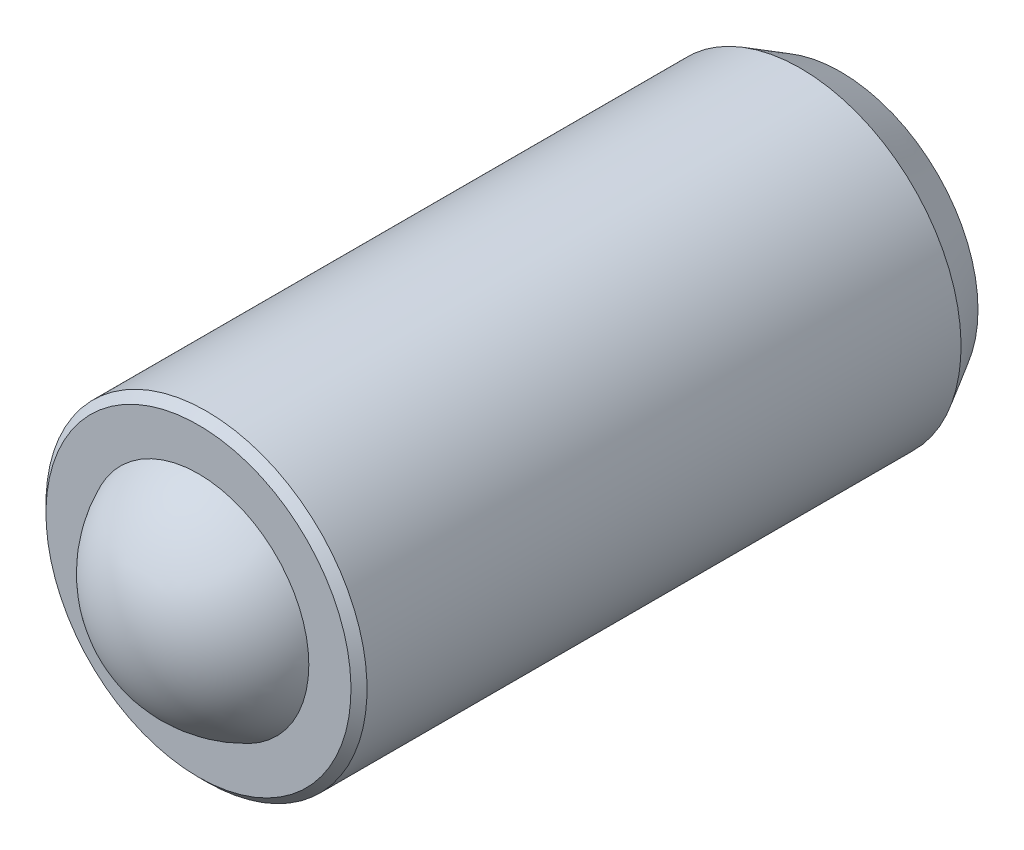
ISO-10303-21;
HEADER;
FILE_DESCRIPTION(('STEP AP214'),'2;1');
FILE_NAME('part.step','',(''),(''),'','','');
FILE_SCHEMA(('AUTOMOTIVE_DESIGN { 1 0 10303 214 1 1 1 1 }'));
ENDSEC;
DATA;
#1=APPLICATION_CONTEXT('core data for automotive mechanical design processes');
#2=APPLICATION_PROTOCOL_DEFINITION('international standard','automotive_design',2000,#1);
#3=PRODUCT_CONTEXT('',#1,'mechanical');
#4=PRODUCT('Part','Part','',(#3));
#5=PRODUCT_RELATED_PRODUCT_CATEGORY('part','',(#4));
#6=PRODUCT_DEFINITION_FORMATION('','',#4);
#7=PRODUCT_DEFINITION_CONTEXT('part definition',#1,'design');
#8=PRODUCT_DEFINITION('design','',#6,#7);
#9=PRODUCT_DEFINITION_SHAPE('','',#8);
#10=(LENGTH_UNIT() NAMED_UNIT(*) SI_UNIT(.MILLI.,.METRE.));
#11=(NAMED_UNIT(*) PLANE_ANGLE_UNIT() SI_UNIT($,.RADIAN.));
#12=(NAMED_UNIT(*) SI_UNIT($,.STERADIAN.) SOLID_ANGLE_UNIT());
#13=UNCERTAINTY_MEASURE_WITH_UNIT(LENGTH_MEASURE(1.E-05),#10,'distance_accuracy_value','');
#14=(GEOMETRIC_REPRESENTATION_CONTEXT(3) GLOBAL_UNCERTAINTY_ASSIGNED_CONTEXT((#13)) GLOBAL_UNIT_ASSIGNED_CONTEXT((#10,
#11,#12)) REPRESENTATION_CONTEXT('',''));
#15=CARTESIAN_POINT('',(0.,0.,0.));
#16=DIRECTION('',(0.,0.,1.));
#17=DIRECTION('',(1.,0.,0.));
#18=AXIS2_PLACEMENT_3D('',#15,#16,#17);
#19=CARTESIAN_POINT('',(0.,0.,0.));
#20=DIRECTION('',(0.,0.,-1.));
#21=DIRECTION('',(0.,1.,0.));
#22=AXIS2_PLACEMENT_3D('',#19,#20,#21);
#23=PLANE('',#22);
#24=CARTESIAN_POINT('',(0.,0.,0.));
#25=DIRECTION('',(0.,0.,-1.));
#26=DIRECTION('',(0.,1.,0.));
#27=AXIS2_PLACEMENT_3D('',#24,#25,#26);
#28=CIRCLE('',#27,3.42264973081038);
#29=CARTESIAN_POINT('',(0.,3.42264973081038,0.));
#30=VERTEX_POINT('',#29);
#31=EDGE_CURVE('E19',#30,#30,#28,.T.);
#32=ORIENTED_EDGE('',*,*,#31,.T.);
#33=EDGE_LOOP('',(#32));
#34=FACE_BOUND('',#33,.T.);
#35=ADVANCED_FACE('F12',(#34),#23,.T.);
#36=CARTESIAN_POINT('',(0.,0.,-5.56770138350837));
#37=DIRECTION('',(0.,0.,-1.));
#38=DIRECTION('',(0.,1.,0.));
#39=AXIS2_PLACEMENT_3D('',#36,#37,#38);
#40=CYLINDRICAL_SURFACE('',#39,4.);
#41=CARTESIAN_POINT('',(0.,0.,1.));
#42=DIRECTION('',(0.,0.,-1.));
#43=DIRECTION('',(0.,1.,0.));
#44=AXIS2_PLACEMENT_3D('',#41,#42,#43);
#45=CIRCLE('',#44,4.);
#46=CARTESIAN_POINT('',(0.,4.,1.00000000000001));
#47=VERTEX_POINT('',#46);
#48=EDGE_CURVE('E8',#47,#47,#45,.F.);
#49=ORIENTED_EDGE('',*,*,#48,.T.);
#50=EDGE_LOOP('',(#49));
#51=FACE_BOUND('',#50,.T.);
#52=CARTESIAN_POINT('',(0.,0.,15.8));
#53=DIRECTION('',(0.,0.,1.));
#54=DIRECTION('',(0.,-1.,0.));
#55=AXIS2_PLACEMENT_3D('',#52,#53,#54);
#56=CIRCLE('',#55,4.);
#57=CARTESIAN_POINT('',(0.,-4.00000000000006,15.8));
#58=VERTEX_POINT('',#57);
#59=EDGE_CURVE('E27',#58,#58,#56,.F.);
#60=ORIENTED_EDGE('',*,*,#59,.T.);
#61=EDGE_LOOP('',(#60));
#62=FACE_BOUND('',#61,.T.);
#63=ADVANCED_FACE('F49',(#51,#62),#40,.T.);
#64=CARTESIAN_POINT('',(4.,0.,16.));
#65=DIRECTION('',(0.,0.,1.));
#66=DIRECTION('',(0.,-1.,0.));
#67=AXIS2_PLACEMENT_3D('',#64,#65,#66);
#68=PLANE('',#67);
#69=CARTESIAN_POINT('',(0.,0.,16.));
#70=DIRECTION('',(0.,0.,1.));
#71=DIRECTION('',(0.,-1.,0.));
#72=AXIS2_PLACEMENT_3D('',#69,#70,#71);
#73=CIRCLE('',#72,3.8);
#74=CARTESIAN_POINT('',(0.,-3.80000000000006,16.));
#75=VERTEX_POINT('',#74);
#76=EDGE_CURVE('E23',#75,#75,#73,.T.);
#77=ORIENTED_EDGE('',*,*,#76,.T.);
#78=EDGE_LOOP('',(#77));
#79=FACE_BOUND('',#78,.T.);
#80=CARTESIAN_POINT('',(0.,0.,16.));
#81=DIRECTION('',(0.,0.,-1.));
#82=DIRECTION('',(0.,1.,0.));
#83=AXIS2_PLACEMENT_3D('',#80,#81,#82);
#84=CIRCLE('',#83,2.7495454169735);
#85=CARTESIAN_POINT('',(0.,2.74954541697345,16.));
#86=VERTEX_POINT('',#85);
#87=EDGE_CURVE('E32',#86,#86,#84,.T.);
#88=ORIENTED_EDGE('',*,*,#87,.T.);
#89=EDGE_LOOP('',(#88));
#90=FACE_BOUND('',#89,.T.);
#91=ADVANCED_FACE('F36',(#79,#90),#68,.T.);
#92=CARTESIAN_POINT('',(0.,0.,14.8));
#93=DIRECTION('',(0.,0.,-1.));
#94=DIRECTION('',(1.,0.,0.));
#95=AXIS2_PLACEMENT_3D('',#92,#93,#94);
#96=SPHERICAL_SURFACE('',#95,3.);
#97=ORIENTED_EDGE('',*,*,#87,.F.);
#98=EDGE_LOOP('',(#97));
#99=FACE_BOUND('',#98,.T.);
#100=ADVANCED_FACE('F38',(#99),#96,.T.);
#101=CARTESIAN_POINT('',(0.,0.,15.8));
#102=DIRECTION('',(0.,0.,-1.));
#103=DIRECTION('',(0.,1.,0.));
#104=AXIS2_PLACEMENT_3D('',#101,#102,#103);
#105=CONICAL_SURFACE('',#104,4.,0.78539816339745);
#106=ORIENTED_EDGE('',*,*,#76,.F.);
#107=EDGE_LOOP('',(#106));
#108=FACE_BOUND('',#107,.T.);
#109=ORIENTED_EDGE('',*,*,#59,.F.);
#110=EDGE_LOOP('',(#109));
#111=FACE_BOUND('',#110,.T.);
#112=ADVANCED_FACE('F40',(#108,#111),#105,.T.);
#113=CARTESIAN_POINT('',(0.,0.,0.));
#114=DIRECTION('',(0.,0.,1.));
#115=DIRECTION('',(0.,-1.,0.));
#116=AXIS2_PLACEMENT_3D('',#113,#114,#115);
#117=CONICAL_SURFACE('',#116,3.42264973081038,0.523598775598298);
#118=ORIENTED_EDGE('',*,*,#48,.F.);
#119=EDGE_LOOP('',(#118));
#120=FACE_BOUND('',#119,.T.);
#121=ORIENTED_EDGE('',*,*,#31,.F.);
#122=EDGE_LOOP('',(#121));
#123=FACE_BOUND('',#122,.T.);
#124=ADVANCED_FACE('F14',(#120,#123),#117,.T.);
#125=CLOSED_SHELL('',(#35,#63,#91,#100,#112,#124));
#126=MANIFOLD_SOLID_BREP('B1',#125);
#127=ADVANCED_BREP_SHAPE_REPRESENTATION('',(#18,#126),#14);
#128=SHAPE_DEFINITION_REPRESENTATION(#9,#127);
ENDSEC;
END-ISO-10303-21;
